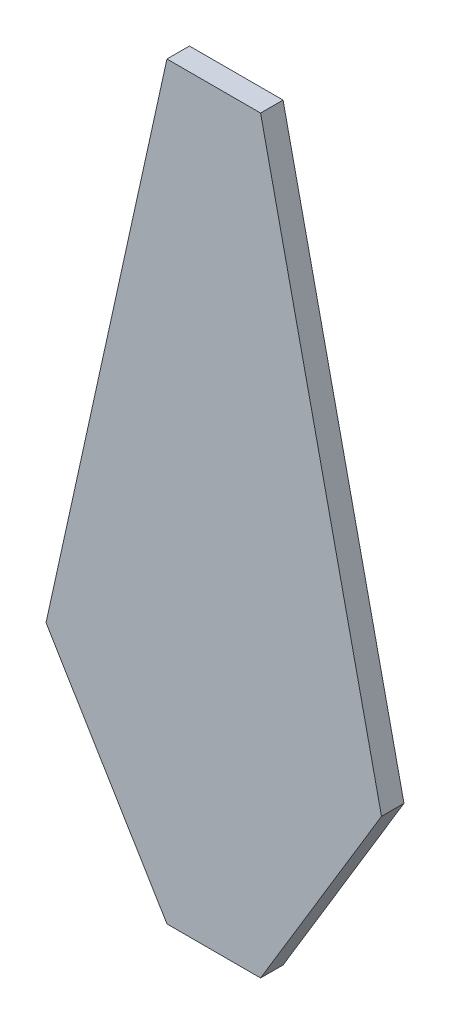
ISO-10303-21;
HEADER;
FILE_DESCRIPTION(('STEP AP214'),'2;1');
FILE_NAME('part.step','',(''),(''),'','','');
FILE_SCHEMA(('AUTOMOTIVE_DESIGN { 1 0 10303 214 1 1 1 1 }'));
ENDSEC;
DATA;
#1=APPLICATION_CONTEXT('core data for automotive mechanical design processes');
#2=APPLICATION_PROTOCOL_DEFINITION('international standard','automotive_design',2000,#1);
#3=PRODUCT_CONTEXT('',#1,'mechanical');
#4=PRODUCT('Part','Part','',(#3));
#5=PRODUCT_RELATED_PRODUCT_CATEGORY('part','',(#4));
#6=PRODUCT_DEFINITION_FORMATION('','',#4);
#7=PRODUCT_DEFINITION_CONTEXT('part definition',#1,'design');
#8=PRODUCT_DEFINITION('design','',#6,#7);
#9=PRODUCT_DEFINITION_SHAPE('','',#8);
#10=(LENGTH_UNIT() NAMED_UNIT(*) SI_UNIT(.MILLI.,.METRE.));
#11=(NAMED_UNIT(*) PLANE_ANGLE_UNIT() SI_UNIT($,.RADIAN.));
#12=(NAMED_UNIT(*) SI_UNIT($,.STERADIAN.) SOLID_ANGLE_UNIT());
#13=UNCERTAINTY_MEASURE_WITH_UNIT(LENGTH_MEASURE(1.E-05),#10,'distance_accuracy_value','');
#14=(GEOMETRIC_REPRESENTATION_CONTEXT(3) GLOBAL_UNCERTAINTY_ASSIGNED_CONTEXT((#13)) GLOBAL_UNIT_ASSIGNED_CONTEXT((#10,
#11,#12)) REPRESENTATION_CONTEXT('',''));
#15=CARTESIAN_POINT('',(0.,0.,0.));
#16=DIRECTION('',(0.,0.,1.));
#17=DIRECTION('',(1.,0.,0.));
#18=AXIS2_PLACEMENT_3D('',#15,#16,#17);
#19=CARTESIAN_POINT('',(0.,0.,0.));
#20=DIRECTION('',(0.,0.,-1.));
#21=DIRECTION('',(-1.,0.,0.));
#22=AXIS2_PLACEMENT_3D('',#19,#20,#21);
#23=PLANE('',#22);
#24=DIRECTION('',(0.,-1.,0.));
#25=VECTOR('',#24,1.);
#26=CARTESIAN_POINT('',(8.25000000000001,-15.,0.));
#27=LINE('',#26,#25);
#28=CARTESIAN_POINT('',(8.25000000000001,-15.,0.));
#29=VERTEX_POINT('',#28);
#30=CARTESIAN_POINT('',(8.25,-41.5,0.));
#31=VERTEX_POINT('',#30);
#32=EDGE_CURVE('E51',#29,#31,#27,.T.);
#33=ORIENTED_EDGE('',*,*,#32,.F.);
#34=DIRECTION('',(1.,0.,0.));
#35=VECTOR('',#34,1.);
#36=CARTESIAN_POINT('',(8.25000000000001,-15.,0.));
#37=LINE('',#36,#35);
#38=CARTESIAN_POINT('',(-8.24999999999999,-15.,0.));
#39=VERTEX_POINT('',#38);
#40=EDGE_CURVE('E181',#39,#29,#37,.T.);
#41=ORIENTED_EDGE('',*,*,#40,.F.);
#42=DIRECTION('',(0.,1.,0.));
#43=VECTOR('',#42,1.);
#44=CARTESIAN_POINT('',(-8.24999999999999,-15.,0.));
#45=LINE('',#44,#43);
#46=CARTESIAN_POINT('',(-8.25,-41.5,0.));
#47=VERTEX_POINT('',#46);
#48=EDGE_CURVE('E184',#47,#39,#45,.T.);
#49=ORIENTED_EDGE('',*,*,#48,.F.);
#50=DIRECTION('',(-1.,0.,0.));
#51=VECTOR('',#50,1.);
#52=CARTESIAN_POINT('',(8.25,-41.5,0.));
#53=LINE('',#52,#51);
#54=EDGE_CURVE('E190',#31,#47,#53,.T.);
#55=ORIENTED_EDGE('',*,*,#54,.F.);
#56=EDGE_LOOP('',(#33,#41,#49,#55));
#57=FACE_BOUND('',#56,.T.);
#58=DIRECTION('',(0.,1.,0.));
#59=VECTOR('',#58,1.);
#60=CARTESIAN_POINT('',(-32.3175220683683,-100.,0.));
#61=LINE('',#60,#59);
#62=CARTESIAN_POINT('',(-32.3175220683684,-560.,0.));
#63=VERTEX_POINT('',#62);
#64=CARTESIAN_POINT('',(-32.3175220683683,-100.,0.));
#65=VERTEX_POINT('',#64);
#66=EDGE_CURVE('E59',#63,#65,#61,.T.);
#67=ORIENTED_EDGE('',*,*,#66,.F.);
#68=DIRECTION('',(-1.,0.,0.));
#69=VECTOR('',#68,1.);
#70=CARTESIAN_POINT('',(32.6824779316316,-560.,0.));
#71=LINE('',#70,#69);
#72=CARTESIAN_POINT('',(32.6824779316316,-560.,0.));
#73=VERTEX_POINT('',#72);
#74=EDGE_CURVE('E203',#73,#63,#71,.T.);
#75=ORIENTED_EDGE('',*,*,#74,.F.);
#76=DIRECTION('',(0.,-1.,0.));
#77=VECTOR('',#76,1.);
#78=CARTESIAN_POINT('',(32.6824779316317,-100.,0.));
#79=LINE('',#78,#77);
#80=CARTESIAN_POINT('',(32.6824779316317,-100.,0.));
#81=VERTEX_POINT('',#80);
#82=EDGE_CURVE('E217',#81,#73,#79,.T.);
#83=ORIENTED_EDGE('',*,*,#82,.F.);
#84=DIRECTION('',(1.,0.,0.));
#85=VECTOR('',#84,1.);
#86=CARTESIAN_POINT('',(32.6824779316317,-100.,0.));
#87=LINE('',#86,#85);
#88=EDGE_CURVE('E214',#65,#81,#87,.T.);
#89=ORIENTED_EDGE('',*,*,#88,.F.);
#90=EDGE_LOOP('',(#67,#75,#83,#89));
#91=FACE_BOUND('',#90,.T.);
#92=DIRECTION('',(-0.215234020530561,-0.9765625,0.));
#93=VECTOR('',#92,1.);
#94=CARTESIAN_POINT('',(-37.5,0.,0.));
#95=LINE('',#94,#93);
#96=CARTESIAN_POINT('',(-37.5,0.,0.));
#97=VERTEX_POINT('',#96);
#98=CARTESIAN_POINT('',(-134.355309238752,-439.453125,0.));
#99=VERTEX_POINT('',#98);
#100=EDGE_CURVE('E258',#97,#99,#95,.T.);
#101=ORIENTED_EDGE('',*,*,#100,.F.);
#102=DIRECTION('',(-1.,0.,0.));
#103=VECTOR('',#102,1.);
#104=CARTESIAN_POINT('',(37.5,0.,0.));
#105=LINE('',#104,#103);
#106=CARTESIAN_POINT('',(37.5,0.,0.));
#107=VERTEX_POINT('',#106);
#108=EDGE_CURVE('E263',#107,#97,#105,.T.);
#109=ORIENTED_EDGE('',*,*,#108,.F.);
#110=DIRECTION('',(-0.215234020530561,0.9765625,0.));
#111=VECTOR('',#110,1.);
#112=CARTESIAN_POINT('',(37.5,0.,0.));
#113=LINE('',#112,#111);
#114=CARTESIAN_POINT('',(134.355309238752,-439.453125,0.));
#115=VERTEX_POINT('',#114);
#116=EDGE_CURVE('E282',#115,#107,#113,.T.);
#117=ORIENTED_EDGE('',*,*,#116,.F.);
#118=DIRECTION('',(0.516561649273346,0.85625,0.));
#119=VECTOR('',#118,1.);
#120=CARTESIAN_POINT('',(134.355309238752,-439.453125,0.));
#121=LINE('',#120,#119);
#122=CARTESIAN_POINT('',(37.5000000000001,-600.,0.));
#123=VERTEX_POINT('',#122);
#124=EDGE_CURVE('E280',#123,#115,#121,.T.);
#125=ORIENTED_EDGE('',*,*,#124,.F.);
#126=DIRECTION('',(1.,0.,0.));
#127=VECTOR('',#126,1.);
#128=CARTESIAN_POINT('',(37.5000000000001,-600.,0.));
#129=LINE('',#128,#127);
#130=CARTESIAN_POINT('',(-37.4999999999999,-600.,0.));
#131=VERTEX_POINT('',#130);
#132=EDGE_CURVE('E278',#131,#123,#129,.T.);
#133=ORIENTED_EDGE('',*,*,#132,.F.);
#134=DIRECTION('',(0.516561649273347,-0.85625,0.));
#135=VECTOR('',#134,1.);
#136=CARTESIAN_POINT('',(-134.355309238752,-439.453125,0.));
#137=LINE('',#136,#135);
#138=EDGE_CURVE('E276',#99,#131,#137,.T.);
#139=ORIENTED_EDGE('',*,*,#138,.F.);
#140=EDGE_LOOP('',(#101,#109,#117,#125,#133,#139));
#141=FACE_BOUND('',#140,.T.);
#142=ADVANCED_FACE('F36',(#57,#91,#141),#23,.T.);
#143=CARTESIAN_POINT('',(-37.5,0.,18.));
#144=DIRECTION('',(0.9765625,-0.215234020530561,0.));
#145=DIRECTION('',(0.215234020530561,0.9765625,0.));
#146=AXIS2_PLACEMENT_3D('',#143,#144,#145);
#147=PLANE('',#146);
#148=ORIENTED_EDGE('',*,*,#100,.T.);
#149=DIRECTION('',(0.,0.,-1.));
#150=VECTOR('',#149,1.);
#151=CARTESIAN_POINT('',(-134.355309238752,-439.453125,18.));
#152=LINE('',#151,#150);
#153=CARTESIAN_POINT('',(-134.355309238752,-439.453125,18.));
#154=VERTEX_POINT('',#153);
#155=EDGE_CURVE('E44',#154,#99,#152,.T.);
#156=ORIENTED_EDGE('',*,*,#155,.F.);
#157=DIRECTION('',(-0.215234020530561,-0.9765625,0.));
#158=VECTOR('',#157,1.);
#159=CARTESIAN_POINT('',(-37.5,0.,18.));
#160=LINE('',#159,#158);
#161=CARTESIAN_POINT('',(-37.5,0.,18.));
#162=VERTEX_POINT('',#161);
#163=EDGE_CURVE('E259',#162,#154,#160,.T.);
#164=ORIENTED_EDGE('',*,*,#163,.F.);
#165=DIRECTION('',(0.,0.,-1.));
#166=VECTOR('',#165,1.);
#167=CARTESIAN_POINT('',(-37.5,0.,18.));
#168=LINE('',#167,#166);
#169=EDGE_CURVE('E273',#162,#97,#168,.T.);
#170=ORIENTED_EDGE('',*,*,#169,.T.);
#171=EDGE_LOOP('',(#148,#156,#164,#170));
#172=FACE_BOUND('',#171,.T.);
#173=ADVANCED_FACE('F38',(#172),#147,.F.);
#174=CARTESIAN_POINT('',(-134.355309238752,-439.453125,18.));
#175=DIRECTION('',(0.85625,0.516561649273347,0.));
#176=DIRECTION('',(-0.516561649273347,0.85625,0.));
#177=AXIS2_PLACEMENT_3D('',#174,#175,#176);
#178=PLANE('',#177);
#179=ORIENTED_EDGE('',*,*,#138,.T.);
#180=DIRECTION('',(0.,0.,-1.));
#181=VECTOR('',#180,1.);
#182=CARTESIAN_POINT('',(-37.4999999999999,-600.,18.));
#183=LINE('',#182,#181);
#184=CARTESIAN_POINT('',(-37.4999999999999,-600.,18.));
#185=VERTEX_POINT('',#184);
#186=EDGE_CURVE('E296',#185,#131,#183,.T.);
#187=ORIENTED_EDGE('',*,*,#186,.F.);
#188=DIRECTION('',(0.516561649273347,-0.85625,0.));
#189=VECTOR('',#188,1.);
#190=CARTESIAN_POINT('',(-134.355309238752,-439.453125,18.));
#191=LINE('',#190,#189);
#192=EDGE_CURVE('E262',#154,#185,#191,.T.);
#193=ORIENTED_EDGE('',*,*,#192,.F.);
#194=ORIENTED_EDGE('',*,*,#155,.T.);
#195=EDGE_LOOP('',(#179,#187,#193,#194));
#196=FACE_BOUND('',#195,.T.);
#197=ADVANCED_FACE('F301',(#196),#178,.F.);
#198=CARTESIAN_POINT('',(37.5000000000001,-600.,18.));
#199=DIRECTION('',(0.,1.,0.));
#200=DIRECTION('',(0.,0.,1.));
#201=AXIS2_PLACEMENT_3D('',#198,#199,#200);
#202=PLANE('',#201);
#203=ORIENTED_EDGE('',*,*,#132,.T.);
#204=DIRECTION('',(0.,0.,-1.));
#205=VECTOR('',#204,1.);
#206=CARTESIAN_POINT('',(37.5000000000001,-600.,18.));
#207=LINE('',#206,#205);
#208=CARTESIAN_POINT('',(37.5000000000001,-600.,18.));
#209=VERTEX_POINT('',#208);
#210=EDGE_CURVE('E293',#209,#123,#207,.T.);
#211=ORIENTED_EDGE('',*,*,#210,.F.);
#212=DIRECTION('',(1.,0.,0.));
#213=VECTOR('',#212,1.);
#214=CARTESIAN_POINT('',(37.5000000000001,-600.,18.));
#215=LINE('',#214,#213);
#216=EDGE_CURVE('E265',#185,#209,#215,.T.);
#217=ORIENTED_EDGE('',*,*,#216,.F.);
#218=ORIENTED_EDGE('',*,*,#186,.T.);
#219=EDGE_LOOP('',(#203,#211,#217,#218));
#220=FACE_BOUND('',#219,.T.);
#221=ADVANCED_FACE('F314',(#220),#202,.F.);
#222=CARTESIAN_POINT('',(134.355309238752,-439.453125,18.));
#223=DIRECTION('',(-0.85625,0.516561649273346,0.));
#224=DIRECTION('',(-0.516561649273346,-0.85625,0.));
#225=AXIS2_PLACEMENT_3D('',#222,#223,#224);
#226=PLANE('',#225);
#227=ORIENTED_EDGE('',*,*,#124,.T.);
#228=DIRECTION('',(0.,0.,-1.));
#229=VECTOR('',#228,1.);
#230=CARTESIAN_POINT('',(134.355309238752,-439.453125,18.));
#231=LINE('',#230,#229);
#232=CARTESIAN_POINT('',(134.355309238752,-439.453125,18.));
#233=VERTEX_POINT('',#232);
#234=EDGE_CURVE('E290',#233,#115,#231,.T.);
#235=ORIENTED_EDGE('',*,*,#234,.F.);
#236=DIRECTION('',(0.516561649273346,0.85625,0.));
#237=VECTOR('',#236,1.);
#238=CARTESIAN_POINT('',(134.355309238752,-439.453125,18.));
#239=LINE('',#238,#237);
#240=EDGE_CURVE('E267',#209,#233,#239,.T.);
#241=ORIENTED_EDGE('',*,*,#240,.F.);
#242=ORIENTED_EDGE('',*,*,#210,.T.);
#243=EDGE_LOOP('',(#227,#235,#241,#242));
#244=FACE_BOUND('',#243,.T.);
#245=ADVANCED_FACE('F318',(#244),#226,.F.);
#246=CARTESIAN_POINT('',(37.5,0.,18.));
#247=DIRECTION('',(-0.9765625,-0.215234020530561,0.));
#248=DIRECTION('',(0.215234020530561,-0.9765625,0.));
#249=AXIS2_PLACEMENT_3D('',#246,#247,#248);
#250=PLANE('',#249);
#251=ORIENTED_EDGE('',*,*,#116,.T.);
#252=DIRECTION('',(0.,0.,-1.));
#253=VECTOR('',#252,1.);
#254=CARTESIAN_POINT('',(37.5,0.,18.));
#255=LINE('',#254,#253);
#256=CARTESIAN_POINT('',(37.5,0.,18.));
#257=VERTEX_POINT('',#256);
#258=EDGE_CURVE('E287',#257,#107,#255,.T.);
#259=ORIENTED_EDGE('',*,*,#258,.F.);
#260=DIRECTION('',(-0.215234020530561,0.9765625,0.));
#261=VECTOR('',#260,1.);
#262=CARTESIAN_POINT('',(37.5,0.,18.));
#263=LINE('',#262,#261);
#264=EDGE_CURVE('E269',#233,#257,#263,.T.);
#265=ORIENTED_EDGE('',*,*,#264,.F.);
#266=ORIENTED_EDGE('',*,*,#234,.T.);
#267=EDGE_LOOP('',(#251,#259,#265,#266));
#268=FACE_BOUND('',#267,.T.);
#269=ADVANCED_FACE('F328',(#268),#250,.F.);
#270=CARTESIAN_POINT('',(37.5,0.,18.));
#271=DIRECTION('',(0.,-1.,0.));
#272=DIRECTION('',(1.,0.,0.));
#273=AXIS2_PLACEMENT_3D('',#270,#271,#272);
#274=PLANE('',#273);
#275=ORIENTED_EDGE('',*,*,#108,.T.);
#276=ORIENTED_EDGE('',*,*,#169,.F.);
#277=DIRECTION('',(-1.,0.,0.));
#278=VECTOR('',#277,1.);
#279=CARTESIAN_POINT('',(37.5,0.,18.));
#280=LINE('',#279,#278);
#281=EDGE_CURVE('E271',#257,#162,#280,.T.);
#282=ORIENTED_EDGE('',*,*,#281,.F.);
#283=ORIENTED_EDGE('',*,*,#258,.T.);
#284=EDGE_LOOP('',(#275,#276,#282,#283));
#285=FACE_BOUND('',#284,.T.);
#286=ADVANCED_FACE('F326',(#285),#274,.F.);
#287=CARTESIAN_POINT('',(0.,0.,18.));
#288=DIRECTION('',(0.,0.,-1.));
#289=DIRECTION('',(-1.,0.,0.));
#290=AXIS2_PLACEMENT_3D('',#287,#288,#289);
#291=PLANE('',#290);
#292=ORIENTED_EDGE('',*,*,#163,.T.);
#293=ORIENTED_EDGE('',*,*,#192,.T.);
#294=ORIENTED_EDGE('',*,*,#216,.T.);
#295=ORIENTED_EDGE('',*,*,#240,.T.);
#296=ORIENTED_EDGE('',*,*,#264,.T.);
#297=ORIENTED_EDGE('',*,*,#281,.T.);
#298=EDGE_LOOP('',(#292,#293,#294,#295,#296,#297));
#299=FACE_BOUND('',#298,.T.);
#300=ADVANCED_FACE('F322',(#299),#291,.F.);
#301=CARTESIAN_POINT('',(-32.3175220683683,-100.,3.));
#302=DIRECTION('',(-1.,0.,0.));
#303=DIRECTION('',(0.,-1.,0.));
#304=AXIS2_PLACEMENT_3D('',#301,#302,#303);
#305=PLANE('',#304);
#306=ORIENTED_EDGE('',*,*,#66,.T.);
#307=DIRECTION('',(0.,0.,-1.));
#308=VECTOR('',#307,1.);
#309=CARTESIAN_POINT('',(-32.3175220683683,-100.,3.));
#310=LINE('',#309,#308);
#311=CARTESIAN_POINT('',(-32.3175220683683,-100.,3.));
#312=VERTEX_POINT('',#311);
#313=EDGE_CURVE('E212',#312,#65,#310,.T.);
#314=ORIENTED_EDGE('',*,*,#313,.F.);
#315=DIRECTION('',(0.,1.,0.));
#316=VECTOR('',#315,1.);
#317=CARTESIAN_POINT('',(-32.3175220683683,-100.,3.));
#318=LINE('',#317,#316);
#319=CARTESIAN_POINT('',(-32.3175220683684,-560.,3.));
#320=VERTEX_POINT('',#319);
#321=EDGE_CURVE('E199',#320,#312,#318,.T.);
#322=ORIENTED_EDGE('',*,*,#321,.F.);
#323=DIRECTION('',(0.,0.,-1.));
#324=VECTOR('',#323,1.);
#325=CARTESIAN_POINT('',(-32.3175220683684,-560.,3.));
#326=LINE('',#325,#324);
#327=EDGE_CURVE('E222',#320,#63,#326,.T.);
#328=ORIENTED_EDGE('',*,*,#327,.T.);
#329=EDGE_LOOP('',(#306,#314,#322,#328));
#330=FACE_BOUND('',#329,.T.);
#331=ADVANCED_FACE('F347',(#330),#305,.F.);
#332=CARTESIAN_POINT('',(32.6824779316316,-560.,3.));
#333=DIRECTION('',(0.,-1.,0.));
#334=DIRECTION('',(0.,0.,-1.));
#335=AXIS2_PLACEMENT_3D('',#332,#333,#334);
#336=PLANE('',#335);
#337=ORIENTED_EDGE('',*,*,#74,.T.);
#338=ORIENTED_EDGE('',*,*,#327,.F.);
#339=DIRECTION('',(-1.,0.,0.));
#340=VECTOR('',#339,1.);
#341=CARTESIAN_POINT('',(32.6824779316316,-560.,3.));
#342=LINE('',#341,#340);
#343=CARTESIAN_POINT('',(32.6824779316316,-560.,3.));
#344=VERTEX_POINT('',#343);
#345=EDGE_CURVE('E209',#344,#320,#342,.T.);
#346=ORIENTED_EDGE('',*,*,#345,.F.);
#347=DIRECTION('',(0.,0.,-1.));
#348=VECTOR('',#347,1.);
#349=CARTESIAN_POINT('',(32.6824779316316,-560.,3.));
#350=LINE('',#349,#348);
#351=EDGE_CURVE('E225',#344,#73,#350,.T.);
#352=ORIENTED_EDGE('',*,*,#351,.T.);
#353=EDGE_LOOP('',(#337,#338,#346,#352));
#354=FACE_BOUND('',#353,.T.);
#355=ADVANCED_FACE('F371',(#354),#336,.F.);
#356=CARTESIAN_POINT('',(32.6824779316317,-100.,3.));
#357=DIRECTION('',(1.,0.,0.));
#358=DIRECTION('',(0.,1.,0.));
#359=AXIS2_PLACEMENT_3D('',#356,#357,#358);
#360=PLANE('',#359);
#361=ORIENTED_EDGE('',*,*,#82,.T.);
#362=ORIENTED_EDGE('',*,*,#351,.F.);
#363=DIRECTION('',(0.,-1.,0.));
#364=VECTOR('',#363,1.);
#365=CARTESIAN_POINT('',(32.6824779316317,-100.,3.));
#366=LINE('',#365,#364);
#367=CARTESIAN_POINT('',(32.6824779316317,-100.,3.));
#368=VERTEX_POINT('',#367);
#369=EDGE_CURVE('E206',#368,#344,#366,.T.);
#370=ORIENTED_EDGE('',*,*,#369,.F.);
#371=DIRECTION('',(0.,0.,-1.));
#372=VECTOR('',#371,1.);
#373=CARTESIAN_POINT('',(32.6824779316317,-100.,3.));
#374=LINE('',#373,#372);
#375=EDGE_CURVE('E227',#368,#81,#374,.T.);
#376=ORIENTED_EDGE('',*,*,#375,.T.);
#377=EDGE_LOOP('',(#361,#362,#370,#376));
#378=FACE_BOUND('',#377,.T.);
#379=ADVANCED_FACE('F375',(#378),#360,.F.);
#380=CARTESIAN_POINT('',(32.6824779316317,-100.,3.));
#381=DIRECTION('',(0.,1.,0.));
#382=DIRECTION('',(0.,0.,1.));
#383=AXIS2_PLACEMENT_3D('',#380,#381,#382);
#384=PLANE('',#383);
#385=ORIENTED_EDGE('',*,*,#88,.T.);
#386=ORIENTED_EDGE('',*,*,#375,.F.);
#387=DIRECTION('',(1.,0.,0.));
#388=VECTOR('',#387,1.);
#389=CARTESIAN_POINT('',(32.6824779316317,-100.,3.));
#390=LINE('',#389,#388);
#391=EDGE_CURVE('E202',#312,#368,#390,.T.);
#392=ORIENTED_EDGE('',*,*,#391,.F.);
#393=ORIENTED_EDGE('',*,*,#313,.T.);
#394=EDGE_LOOP('',(#385,#386,#392,#393));
#395=FACE_BOUND('',#394,.T.);
#396=ADVANCED_FACE('F372',(#395),#384,.F.);
#397=CARTESIAN_POINT('',(0.,0.,3.));
#398=DIRECTION('',(0.,0.,-1.));
#399=DIRECTION('',(-1.,0.,0.));
#400=AXIS2_PLACEMENT_3D('',#397,#398,#399);
#401=PLANE('',#400);
#402=DIRECTION('',(0.,1.,0.));
#403=VECTOR('',#402,1.);
#404=CARTESIAN_POINT('',(27.5,-105.,3.));
#405=LINE('',#404,#403);
#406=CARTESIAN_POINT('',(27.4999999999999,-555.,3.));
#407=VERTEX_POINT('',#406);
#408=CARTESIAN_POINT('',(27.5,-105.,3.));
#409=VERTEX_POINT('',#408);
#410=EDGE_CURVE('E231',#407,#409,#405,.T.);
#411=ORIENTED_EDGE('',*,*,#410,.T.);
#412=DIRECTION('',(-1.,0.,0.));
#413=VECTOR('',#412,1.);
#414=CARTESIAN_POINT('',(-27.5,-105.,3.));
#415=LINE('',#414,#413);
#416=CARTESIAN_POINT('',(-27.5,-105.,3.));
#417=VERTEX_POINT('',#416);
#418=EDGE_CURVE('E224',#409,#417,#415,.T.);
#419=ORIENTED_EDGE('',*,*,#418,.T.);
#420=DIRECTION('',(0.,1.,0.));
#421=VECTOR('',#420,1.);
#422=CARTESIAN_POINT('',(-27.5,-105.,3.));
#423=LINE('',#422,#421);
#424=CARTESIAN_POINT('',(-27.5000000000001,-555.,3.));
#425=VERTEX_POINT('',#424);
#426=EDGE_CURVE('E11',#425,#417,#423,.T.);
#427=ORIENTED_EDGE('',*,*,#426,.F.);
#428=DIRECTION('',(-1.,0.,0.));
#429=VECTOR('',#428,1.);
#430=CARTESIAN_POINT('',(-27.5000000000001,-555.,3.));
#431=LINE('',#430,#429);
#432=EDGE_CURVE('E233',#407,#425,#431,.T.);
#433=ORIENTED_EDGE('',*,*,#432,.F.);
#434=EDGE_LOOP('',(#411,#419,#427,#433));
#435=FACE_BOUND('',#434,.T.);
#436=ORIENTED_EDGE('',*,*,#321,.T.);
#437=ORIENTED_EDGE('',*,*,#391,.T.);
#438=ORIENTED_EDGE('',*,*,#369,.T.);
#439=ORIENTED_EDGE('',*,*,#345,.T.);
#440=EDGE_LOOP('',(#436,#437,#438,#439));
#441=FACE_BOUND('',#440,.T.);
#442=ADVANCED_FACE('F367',(#435,#441),#401,.T.);
#443=CARTESIAN_POINT('',(0.,0.,10.));
#444=DIRECTION('',(0.,0.,-1.));
#445=DIRECTION('',(-1.,0.,0.));
#446=AXIS2_PLACEMENT_3D('',#443,#444,#445);
#447=PLANE('',#446);
#448=DIRECTION('',(1.,0.,0.));
#449=VECTOR('',#448,1.);
#450=CARTESIAN_POINT('',(-27.5000000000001,-555.,10.));
#451=LINE('',#450,#449);
#452=CARTESIAN_POINT('',(-27.5000000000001,-555.,10.));
#453=VERTEX_POINT('',#452);
#454=CARTESIAN_POINT('',(27.4999999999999,-555.,10.));
#455=VERTEX_POINT('',#454);
#456=EDGE_CURVE('E236',#453,#455,#451,.T.);
#457=ORIENTED_EDGE('',*,*,#456,.F.);
#458=DIRECTION('',(0.,-1.,0.));
#459=VECTOR('',#458,1.);
#460=CARTESIAN_POINT('',(-27.5,-105.,10.));
#461=LINE('',#460,#459);
#462=CARTESIAN_POINT('',(-27.5,-105.,10.));
#463=VERTEX_POINT('',#462);
#464=EDGE_CURVE('E244',#463,#453,#461,.T.);
#465=ORIENTED_EDGE('',*,*,#464,.F.);
#466=DIRECTION('',(1.,0.,0.));
#467=VECTOR('',#466,1.);
#468=CARTESIAN_POINT('',(-27.5,-105.,10.));
#469=LINE('',#468,#467);
#470=CARTESIAN_POINT('',(27.5,-105.,10.));
#471=VERTEX_POINT('',#470);
#472=EDGE_CURVE('E241',#463,#471,#469,.T.);
#473=ORIENTED_EDGE('',*,*,#472,.T.);
#474=DIRECTION('',(0.,-1.,0.));
#475=VECTOR('',#474,1.);
#476=CARTESIAN_POINT('',(27.5,-105.,10.));
#477=LINE('',#476,#475);
#478=EDGE_CURVE('E238',#471,#455,#477,.T.);
#479=ORIENTED_EDGE('',*,*,#478,.T.);
#480=EDGE_LOOP('',(#457,#465,#473,#479));
#481=FACE_BOUND('',#480,.T.);
#482=ADVANCED_FACE('F363',(#481),#447,.T.);
#483=CARTESIAN_POINT('',(-27.5,-105.,10.));
#484=DIRECTION('',(1.,0.,0.));
#485=DIRECTION('',(0.,1.,0.));
#486=AXIS2_PLACEMENT_3D('',#483,#484,#485);
#487=PLANE('',#486);
#488=DIRECTION('',(0.,0.,-1.));
#489=VECTOR('',#488,1.);
#490=CARTESIAN_POINT('',(-27.5000000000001,-555.,10.));
#491=LINE('',#490,#489);
#492=EDGE_CURVE('E246',#453,#425,#491,.T.);
#493=ORIENTED_EDGE('',*,*,#492,.T.);
#494=ORIENTED_EDGE('',*,*,#426,.T.);
#495=DIRECTION('',(0.,0.,-1.));
#496=VECTOR('',#495,1.);
#497=CARTESIAN_POINT('',(-27.5,-105.,10.));
#498=LINE('',#497,#496);
#499=EDGE_CURVE('E249',#463,#417,#498,.T.);
#500=ORIENTED_EDGE('',*,*,#499,.F.);
#501=ORIENTED_EDGE('',*,*,#464,.T.);
#502=EDGE_LOOP('',(#493,#494,#500,#501));
#503=FACE_BOUND('',#502,.T.);
#504=ADVANCED_FACE('F359',(#503),#487,.T.);
#505=CARTESIAN_POINT('',(-27.5,-105.,10.));
#506=DIRECTION('',(0.,1.,0.));
#507=DIRECTION('',(0.,0.,1.));
#508=AXIS2_PLACEMENT_3D('',#505,#506,#507);
#509=PLANE('',#508);
#510=ORIENTED_EDGE('',*,*,#418,.F.);
#511=DIRECTION('',(0.,0.,-1.));
#512=VECTOR('',#511,1.);
#513=CARTESIAN_POINT('',(27.5,-105.,10.));
#514=LINE('',#513,#512);
#515=EDGE_CURVE('E252',#471,#409,#514,.T.);
#516=ORIENTED_EDGE('',*,*,#515,.F.);
#517=ORIENTED_EDGE('',*,*,#472,.F.);
#518=ORIENTED_EDGE('',*,*,#499,.T.);
#519=EDGE_LOOP('',(#510,#516,#517,#518));
#520=FACE_BOUND('',#519,.T.);
#521=ADVANCED_FACE('F355',(#520),#509,.F.);
#522=CARTESIAN_POINT('',(27.5,-105.,10.));
#523=DIRECTION('',(1.,0.,0.));
#524=DIRECTION('',(0.,1.,0.));
#525=AXIS2_PLACEMENT_3D('',#522,#523,#524);
#526=PLANE('',#525);
#527=ORIENTED_EDGE('',*,*,#410,.F.);
#528=DIRECTION('',(0.,0.,-1.));
#529=VECTOR('',#528,1.);
#530=CARTESIAN_POINT('',(27.4999999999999,-555.,10.));
#531=LINE('',#530,#529);
#532=EDGE_CURVE('E255',#455,#407,#531,.T.);
#533=ORIENTED_EDGE('',*,*,#532,.F.);
#534=ORIENTED_EDGE('',*,*,#478,.F.);
#535=ORIENTED_EDGE('',*,*,#515,.T.);
#536=EDGE_LOOP('',(#527,#533,#534,#535));
#537=FACE_BOUND('',#536,.T.);
#538=ADVANCED_FACE('F351',(#537),#526,.F.);
#539=CARTESIAN_POINT('',(-27.5000000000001,-555.,10.));
#540=DIRECTION('',(0.,1.,0.));
#541=DIRECTION('',(0.,0.,1.));
#542=AXIS2_PLACEMENT_3D('',#539,#540,#541);
#543=PLANE('',#542);
#544=ORIENTED_EDGE('',*,*,#532,.T.);
#545=ORIENTED_EDGE('',*,*,#432,.T.);
#546=ORIENTED_EDGE('',*,*,#492,.F.);
#547=ORIENTED_EDGE('',*,*,#456,.T.);
#548=EDGE_LOOP('',(#544,#545,#546,#547));
#549=FACE_BOUND('',#548,.T.);
#550=ADVANCED_FACE('F348',(#549),#543,.T.);
#551=CARTESIAN_POINT('',(8.25000000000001,-15.,10.));
#552=DIRECTION('',(1.,0.,0.));
#553=DIRECTION('',(0.,1.,0.));
#554=AXIS2_PLACEMENT_3D('',#551,#552,#553);
#555=PLANE('',#554);
#556=ORIENTED_EDGE('',*,*,#32,.T.);
#557=DIRECTION('',(0.,0.,-1.));
#558=VECTOR('',#557,1.);
#559=CARTESIAN_POINT('',(8.25,-41.5,10.));
#560=LINE('',#559,#558);
#561=CARTESIAN_POINT('',(8.25,-41.5,10.));
#562=VERTEX_POINT('',#561);
#563=EDGE_CURVE('E159',#562,#31,#560,.T.);
#564=ORIENTED_EDGE('',*,*,#563,.F.);
#565=DIRECTION('',(0.,-1.,0.));
#566=VECTOR('',#565,1.);
#567=CARTESIAN_POINT('',(8.25000000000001,-15.,10.));
#568=LINE('',#567,#566);
#569=CARTESIAN_POINT('',(8.25000000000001,-15.,10.));
#570=VERTEX_POINT('',#569);
#571=EDGE_CURVE('E163',#570,#562,#568,.T.);
#572=ORIENTED_EDGE('',*,*,#571,.F.);
#573=DIRECTION('',(0.,0.,-1.));
#574=VECTOR('',#573,1.);
#575=CARTESIAN_POINT('',(8.25000000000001,-15.,10.));
#576=LINE('',#575,#574);
#577=EDGE_CURVE('E194',#570,#29,#576,.T.);
#578=ORIENTED_EDGE('',*,*,#577,.T.);
#579=EDGE_LOOP('',(#556,#564,#572,#578));
#580=FACE_BOUND('',#579,.T.);
#581=ADVANCED_FACE('F161',(#580),#555,.F.);
#582=CARTESIAN_POINT('',(8.25000000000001,-15.,10.));
#583=DIRECTION('',(0.,1.,0.));
#584=DIRECTION('',(0.,0.,1.));
#585=AXIS2_PLACEMENT_3D('',#582,#583,#584);
#586=PLANE('',#585);
#587=ORIENTED_EDGE('',*,*,#40,.T.);
#588=ORIENTED_EDGE('',*,*,#577,.F.);
#589=DIRECTION('',(1.,0.,0.));
#590=VECTOR('',#589,1.);
#591=CARTESIAN_POINT('',(8.25000000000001,-15.,10.));
#592=LINE('',#591,#590);
#593=CARTESIAN_POINT('',(-8.24999999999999,-15.,10.));
#594=VERTEX_POINT('',#593);
#595=EDGE_CURVE('E169',#594,#570,#592,.T.);
#596=ORIENTED_EDGE('',*,*,#595,.F.);
#597=DIRECTION('',(0.,0.,-1.));
#598=VECTOR('',#597,1.);
#599=CARTESIAN_POINT('',(-8.24999999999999,-15.,10.));
#600=LINE('',#599,#598);
#601=EDGE_CURVE('E196',#594,#39,#600,.T.);
#602=ORIENTED_EDGE('',*,*,#601,.T.);
#603=EDGE_LOOP('',(#587,#588,#596,#602));
#604=FACE_BOUND('',#603,.T.);
#605=ADVANCED_FACE('F388',(#604),#586,.F.);
#606=CARTESIAN_POINT('',(-8.24999999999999,-15.,10.));
#607=DIRECTION('',(-1.,0.,0.));
#608=DIRECTION('',(0.,-1.,0.));
#609=AXIS2_PLACEMENT_3D('',#606,#607,#608);
#610=PLANE('',#609);
#611=ORIENTED_EDGE('',*,*,#48,.T.);
#612=ORIENTED_EDGE('',*,*,#601,.F.);
#613=DIRECTION('',(0.,1.,0.));
#614=VECTOR('',#613,1.);
#615=CARTESIAN_POINT('',(-8.24999999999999,-15.,10.));
#616=LINE('',#615,#614);
#617=CARTESIAN_POINT('',(-8.25,-41.5,10.));
#618=VERTEX_POINT('',#617);
#619=EDGE_CURVE('E177',#618,#594,#616,.T.);
#620=ORIENTED_EDGE('',*,*,#619,.F.);
#621=DIRECTION('',(0.,0.,-1.));
#622=VECTOR('',#621,1.);
#623=CARTESIAN_POINT('',(-8.25,-41.5,10.));
#624=LINE('',#623,#622);
#625=EDGE_CURVE('E168',#618,#47,#624,.T.);
#626=ORIENTED_EDGE('',*,*,#625,.T.);
#627=EDGE_LOOP('',(#611,#612,#620,#626));
#628=FACE_BOUND('',#627,.T.);
#629=ADVANCED_FACE('F391',(#628),#610,.F.);
#630=CARTESIAN_POINT('',(8.25,-41.5,10.));
#631=DIRECTION('',(0.,-1.,0.));
#632=DIRECTION('',(0.,0.,-1.));
#633=AXIS2_PLACEMENT_3D('',#630,#631,#632);
#634=PLANE('',#633);
#635=ORIENTED_EDGE('',*,*,#54,.T.);
#636=ORIENTED_EDGE('',*,*,#625,.F.);
#637=DIRECTION('',(-1.,0.,0.));
#638=VECTOR('',#637,1.);
#639=CARTESIAN_POINT('',(8.25,-41.5,10.));
#640=LINE('',#639,#638);
#641=EDGE_CURVE('E172',#562,#618,#640,.T.);
#642=ORIENTED_EDGE('',*,*,#641,.F.);
#643=ORIENTED_EDGE('',*,*,#563,.T.);
#644=EDGE_LOOP('',(#635,#636,#642,#643));
#645=FACE_BOUND('',#644,.T.);
#646=ADVANCED_FACE('F173',(#645),#634,.F.);
#647=CARTESIAN_POINT('',(0.,0.,10.));
#648=DIRECTION('',(0.,0.,-1.));
#649=DIRECTION('',(-1.,0.,0.));
#650=AXIS2_PLACEMENT_3D('',#647,#648,#649);
#651=PLANE('',#650);
#652=ORIENTED_EDGE('',*,*,#571,.T.);
#653=ORIENTED_EDGE('',*,*,#641,.T.);
#654=ORIENTED_EDGE('',*,*,#619,.T.);
#655=ORIENTED_EDGE('',*,*,#595,.T.);
#656=EDGE_LOOP('',(#652,#653,#654,#655));
#657=FACE_BOUND('',#656,.T.);
#658=ADVANCED_FACE('F179',(#657),#651,.T.);
#659=CLOSED_SHELL('',(#142,#173,#197,#221,#245,#269,#286,#300,#331,#355,#379,#396,#442,#482,
#504,#521,#538,#550,#581,#605,#629,#646,#658));
#660=MANIFOLD_SOLID_BREP('B2',#659);
#661=ADVANCED_BREP_SHAPE_REPRESENTATION('',(#18,#660),#14);
#662=SHAPE_DEFINITION_REPRESENTATION(#9,#661);
ENDSEC;
END-ISO-10303-21;
